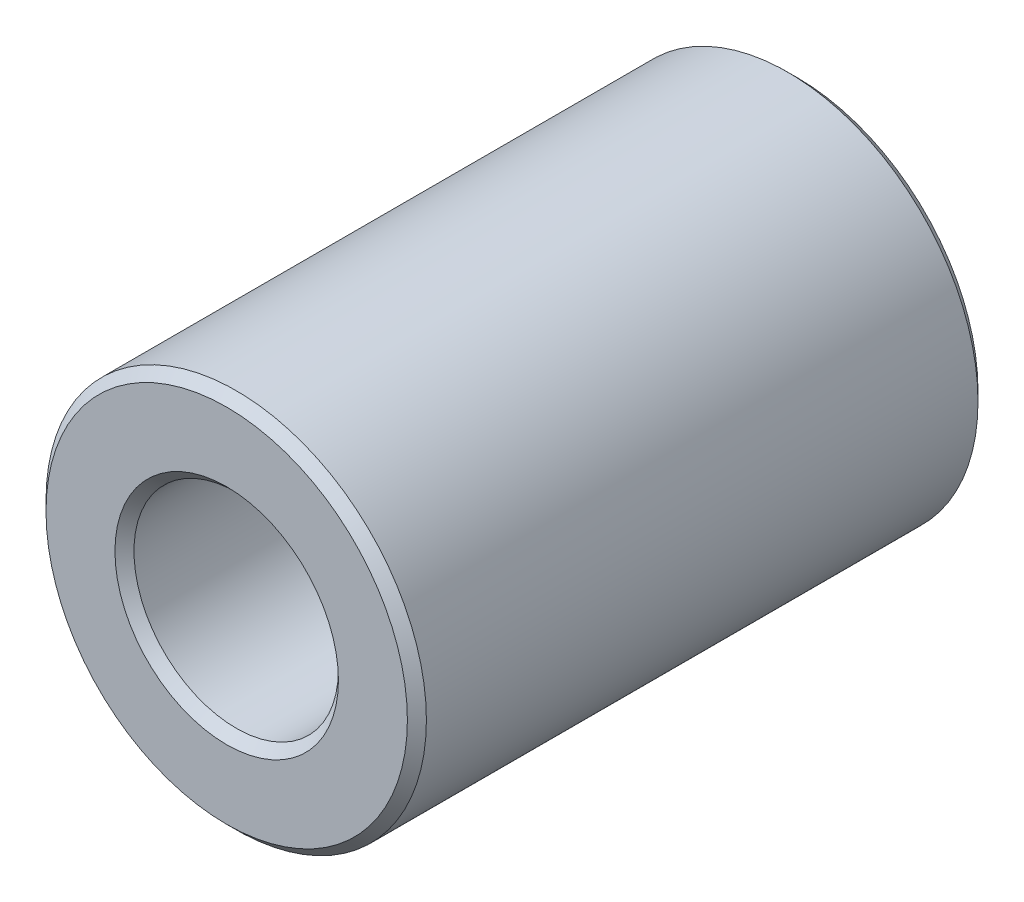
ISO-10303-21;
HEADER;
FILE_DESCRIPTION(('STEP AP214'),'2;1');
FILE_NAME('part.step','',(''),(''),'','','');
FILE_SCHEMA(('AUTOMOTIVE_DESIGN { 1 0 10303 214 1 1 1 1 }'));
ENDSEC;
DATA;
#1=APPLICATION_CONTEXT('core data for automotive mechanical design processes');
#2=APPLICATION_PROTOCOL_DEFINITION('international standard','automotive_design',2000,#1);
#3=PRODUCT_CONTEXT('',#1,'mechanical');
#4=PRODUCT('Part','Part','',(#3));
#5=PRODUCT_RELATED_PRODUCT_CATEGORY('part','',(#4));
#6=PRODUCT_DEFINITION_FORMATION('','',#4);
#7=PRODUCT_DEFINITION_CONTEXT('part definition',#1,'design');
#8=PRODUCT_DEFINITION('design','',#6,#7);
#9=PRODUCT_DEFINITION_SHAPE('','',#8);
#10=(LENGTH_UNIT() NAMED_UNIT(*) SI_UNIT(.MILLI.,.METRE.));
#11=(NAMED_UNIT(*) PLANE_ANGLE_UNIT() SI_UNIT($,.RADIAN.));
#12=(NAMED_UNIT(*) SI_UNIT($,.STERADIAN.) SOLID_ANGLE_UNIT());
#13=UNCERTAINTY_MEASURE_WITH_UNIT(LENGTH_MEASURE(1.E-05),#10,'distance_accuracy_value','');
#14=(GEOMETRIC_REPRESENTATION_CONTEXT(3) GLOBAL_UNCERTAINTY_ASSIGNED_CONTEXT((#13)) GLOBAL_UNIT_ASSIGNED_CONTEXT((#10,
#11,#12)) REPRESENTATION_CONTEXT('',''));
#15=CARTESIAN_POINT('',(0.,0.,0.));
#16=DIRECTION('',(0.,0.,1.));
#17=DIRECTION('',(1.,0.,0.));
#18=AXIS2_PLACEMENT_3D('',#15,#16,#17);
#19=CARTESIAN_POINT('',(0.,0.,6.));
#20=DIRECTION('',(0.,0.,1.));
#21=DIRECTION('',(1.,0.,0.));
#22=AXIS2_PLACEMENT_3D('',#19,#20,#21);
#23=PLANE('',#22);
#24=CARTESIAN_POINT('',(0.,0.,6.));
#25=DIRECTION('',(0.,0.,1.));
#26=DIRECTION('',(1.,0.,0.));
#27=AXIS2_PLACEMENT_3D('',#24,#25,#26);
#28=CIRCLE('',#27,2.35);
#29=CARTESIAN_POINT('',(2.35,0.,6.));
#30=VERTEX_POINT('',#29);
#31=EDGE_CURVE('E10',#30,#30,#28,.F.);
#32=ORIENTED_EDGE('',*,*,#31,.T.);
#33=EDGE_LOOP('',(#32));
#34=FACE_BOUND('',#33,.T.);
#35=CARTESIAN_POINT('',(0.,0.,6.));
#36=DIRECTION('',(0.,0.,1.));
#37=DIRECTION('',(1.,0.,0.));
#38=AXIS2_PLACEMENT_3D('',#35,#36,#37);
#39=CIRCLE('',#38,3.8);
#40=CARTESIAN_POINT('',(3.8,0.,6.));
#41=VERTEX_POINT('',#40);
#42=EDGE_CURVE('E45',#41,#41,#39,.T.);
#43=ORIENTED_EDGE('',*,*,#42,.T.);
#44=EDGE_LOOP('',(#43));
#45=FACE_BOUND('',#44,.T.);
#46=ADVANCED_FACE('F37',(#34,#45),#23,.T.);
#47=CARTESIAN_POINT('',(0.,0.,-6.));
#48=DIRECTION('',(0.,0.,1.));
#49=DIRECTION('',(1.,0.,0.));
#50=AXIS2_PLACEMENT_3D('',#47,#48,#49);
#51=PLANE('',#50);
#52=CARTESIAN_POINT('',(0.,0.,-6.));
#53=DIRECTION('',(0.,0.,1.));
#54=DIRECTION('',(1.,0.,0.));
#55=AXIS2_PLACEMENT_3D('',#52,#53,#54);
#56=CIRCLE('',#55,3.8);
#57=CARTESIAN_POINT('',(3.8,0.,-6.));
#58=VERTEX_POINT('',#57);
#59=EDGE_CURVE('E63',#58,#58,#56,.F.);
#60=ORIENTED_EDGE('',*,*,#59,.T.);
#61=EDGE_LOOP('',(#60));
#62=FACE_BOUND('',#61,.T.);
#63=CARTESIAN_POINT('',(0.,0.,-6.));
#64=DIRECTION('',(0.,0.,1.));
#65=DIRECTION('',(1.,0.,0.));
#66=AXIS2_PLACEMENT_3D('',#63,#64,#65);
#67=CIRCLE('',#66,2.35);
#68=CARTESIAN_POINT('',(2.35,0.,-6.));
#69=VERTEX_POINT('',#68);
#70=EDGE_CURVE('E66',#69,#69,#67,.T.);
#71=ORIENTED_EDGE('',*,*,#70,.T.);
#72=EDGE_LOOP('',(#71));
#73=FACE_BOUND('',#72,.T.);
#74=ADVANCED_FACE('F89',(#62,#73),#51,.F.);
#75=CARTESIAN_POINT('',(0.,0.,6.));
#76=DIRECTION('',(0.,0.,-1.));
#77=DIRECTION('',(-1.,0.,0.));
#78=AXIS2_PLACEMENT_3D('',#75,#76,#77);
#79=CYLINDRICAL_SURFACE('',#78,4.);
#80=CARTESIAN_POINT('',(0.,0.,-5.8));
#81=DIRECTION('',(0.,0.,1.));
#82=DIRECTION('',(1.,0.,0.));
#83=AXIS2_PLACEMENT_3D('',#80,#81,#82);
#84=CIRCLE('',#83,4.);
#85=CARTESIAN_POINT('',(4.,0.,-5.8));
#86=VERTEX_POINT('',#85);
#87=EDGE_CURVE('E69',#86,#86,#84,.T.);
#88=ORIENTED_EDGE('',*,*,#87,.T.);
#89=EDGE_LOOP('',(#88));
#90=FACE_BOUND('',#89,.T.);
#91=CARTESIAN_POINT('',(0.,0.,5.8));
#92=DIRECTION('',(0.,0.,1.));
#93=DIRECTION('',(1.,0.,0.));
#94=AXIS2_PLACEMENT_3D('',#91,#92,#93);
#95=CIRCLE('',#94,4.);
#96=CARTESIAN_POINT('',(4.,0.,5.8));
#97=VERTEX_POINT('',#96);
#98=EDGE_CURVE('E73',#97,#97,#95,.F.);
#99=ORIENTED_EDGE('',*,*,#98,.T.);
#100=EDGE_LOOP('',(#99));
#101=FACE_BOUND('',#100,.T.);
#102=ADVANCED_FACE('F78',(#90,#101),#79,.T.);
#103=CARTESIAN_POINT('',(0.,0.,6.));
#104=DIRECTION('',(0.,0.,-1.));
#105=DIRECTION('',(-1.,0.,0.));
#106=AXIS2_PLACEMENT_3D('',#103,#104,#105);
#107=CYLINDRICAL_SURFACE('',#106,2.15);
#108=CARTESIAN_POINT('',(0.,0.,-5.8));
#109=DIRECTION('',(0.,0.,1.));
#110=DIRECTION('',(1.,0.,0.));
#111=AXIS2_PLACEMENT_3D('',#108,#109,#110);
#112=CIRCLE('',#111,2.15);
#113=CARTESIAN_POINT('',(2.15,0.,-5.8));
#114=VERTEX_POINT('',#113);
#115=EDGE_CURVE('E52',#114,#114,#112,.F.);
#116=ORIENTED_EDGE('',*,*,#115,.T.);
#117=EDGE_LOOP('',(#116));
#118=FACE_BOUND('',#117,.T.);
#119=CARTESIAN_POINT('',(0.,0.,5.8));
#120=DIRECTION('',(0.,0.,1.));
#121=DIRECTION('',(1.,0.,0.));
#122=AXIS2_PLACEMENT_3D('',#119,#120,#121);
#123=CIRCLE('',#122,2.15);
#124=CARTESIAN_POINT('',(2.15,0.,5.8));
#125=VERTEX_POINT('',#124);
#126=EDGE_CURVE('E58',#125,#125,#123,.T.);
#127=ORIENTED_EDGE('',*,*,#126,.T.);
#128=EDGE_LOOP('',(#127));
#129=FACE_BOUND('',#128,.T.);
#130=ADVANCED_FACE('F97',(#118,#129),#107,.F.);
#131=CARTESIAN_POINT('',(0.,0.,-5.8));
#132=DIRECTION('',(0.,0.,1.));
#133=DIRECTION('',(1.,0.,0.));
#134=AXIS2_PLACEMENT_3D('',#131,#132,#133);
#135=CONICAL_SURFACE('',#134,4.,0.785398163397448);
#136=ORIENTED_EDGE('',*,*,#59,.F.);
#137=EDGE_LOOP('',(#136));
#138=FACE_BOUND('',#137,.T.);
#139=ORIENTED_EDGE('',*,*,#87,.F.);
#140=EDGE_LOOP('',(#139));
#141=FACE_BOUND('',#140,.T.);
#142=ADVANCED_FACE('F102',(#138,#141),#135,.T.);
#143=CARTESIAN_POINT('',(0.,0.,-6.));
#144=DIRECTION('',(0.,0.,-1.));
#145=DIRECTION('',(-1.,0.,0.));
#146=AXIS2_PLACEMENT_3D('',#143,#144,#145);
#147=CONICAL_SURFACE('',#146,2.35,0.785398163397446);
#148=ORIENTED_EDGE('',*,*,#115,.F.);
#149=EDGE_LOOP('',(#148));
#150=FACE_BOUND('',#149,.T.);
#151=ORIENTED_EDGE('',*,*,#70,.F.);
#152=EDGE_LOOP('',(#151));
#153=FACE_BOUND('',#152,.T.);
#154=ADVANCED_FACE('F86',(#150,#153),#147,.F.);
#155=CARTESIAN_POINT('',(0.,0.,5.8));
#156=DIRECTION('',(0.,0.,1.));
#157=DIRECTION('',(1.,0.,0.));
#158=AXIS2_PLACEMENT_3D('',#155,#156,#157);
#159=CONICAL_SURFACE('',#158,2.15,0.785398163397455);
#160=ORIENTED_EDGE('',*,*,#31,.F.);
#161=EDGE_LOOP('',(#160));
#162=FACE_BOUND('',#161,.T.);
#163=ORIENTED_EDGE('',*,*,#126,.F.);
#164=EDGE_LOOP('',(#163));
#165=FACE_BOUND('',#164,.T.);
#166=ADVANCED_FACE('F82',(#162,#165),#159,.F.);
#167=CARTESIAN_POINT('',(0.,0.,6.));
#168=DIRECTION('',(0.,0.,-1.));
#169=DIRECTION('',(-1.,0.,0.));
#170=AXIS2_PLACEMENT_3D('',#167,#168,#169);
#171=CONICAL_SURFACE('',#170,3.8,0.78539816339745);
#172=ORIENTED_EDGE('',*,*,#98,.F.);
#173=EDGE_LOOP('',(#172));
#174=FACE_BOUND('',#173,.T.);
#175=ORIENTED_EDGE('',*,*,#42,.F.);
#176=EDGE_LOOP('',(#175));
#177=FACE_BOUND('',#176,.T.);
#178=ADVANCED_FACE('F39',(#174,#177),#171,.T.);
#179=CLOSED_SHELL('',(#46,#74,#102,#130,#142,#154,#166,#178));
#180=MANIFOLD_SOLID_BREP('B2',#179);
#181=ADVANCED_BREP_SHAPE_REPRESENTATION('',(#18,#180),#14);
#182=SHAPE_DEFINITION_REPRESENTATION(#9,#181);
ENDSEC;
END-ISO-10303-21;
